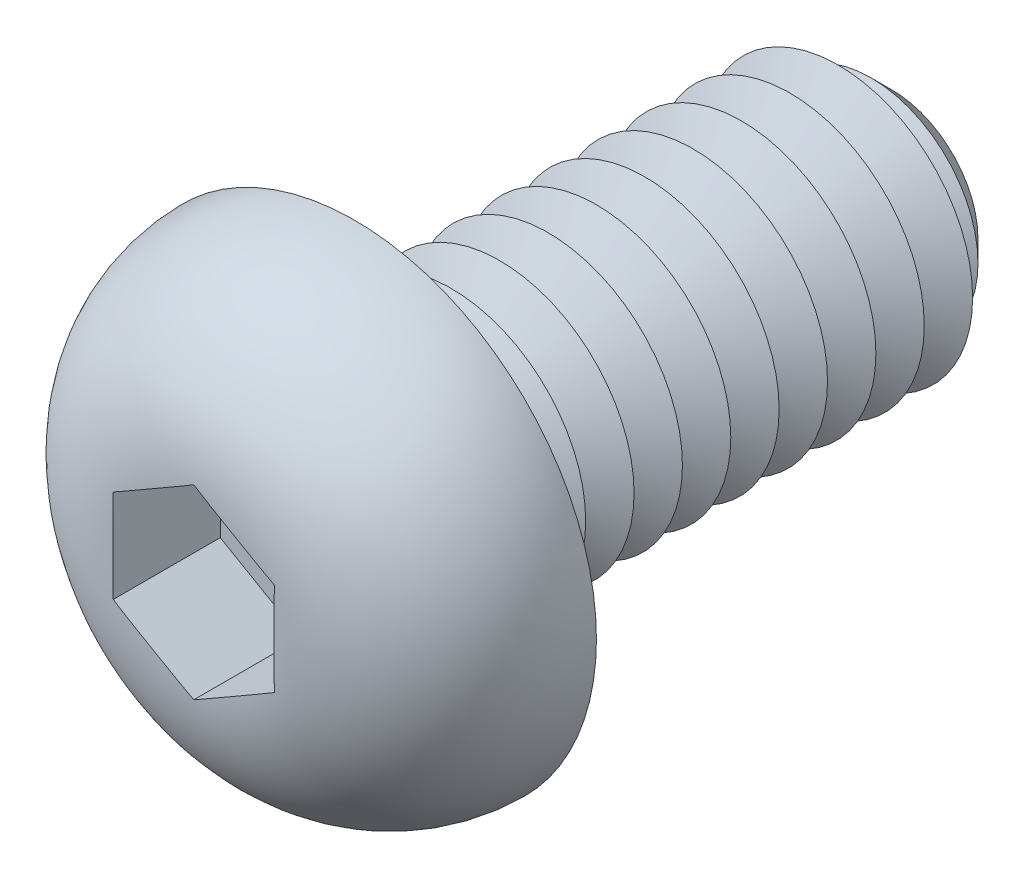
ISO-10303-21;
HEADER;
FILE_DESCRIPTION(('STEP AP214'),'2;1');
FILE_NAME('part.step','',(''),(''),'','','');
FILE_SCHEMA(('AUTOMOTIVE_DESIGN { 1 0 10303 214 1 1 1 1 }'));
ENDSEC;
DATA;
#1=APPLICATION_CONTEXT('core data for automotive mechanical design processes');
#2=APPLICATION_PROTOCOL_DEFINITION('international standard','automotive_design',2000,#1);
#3=PRODUCT_CONTEXT('',#1,'mechanical');
#4=PRODUCT('Part','Part','',(#3));
#5=PRODUCT_RELATED_PRODUCT_CATEGORY('part','',(#4));
#6=PRODUCT_DEFINITION_FORMATION('','',#4);
#7=PRODUCT_DEFINITION_CONTEXT('part definition',#1,'design');
#8=PRODUCT_DEFINITION('design','',#6,#7);
#9=PRODUCT_DEFINITION_SHAPE('','',#8);
#10=(LENGTH_UNIT() NAMED_UNIT(*) SI_UNIT(.MILLI.,.METRE.));
#11=(NAMED_UNIT(*) PLANE_ANGLE_UNIT() SI_UNIT($,.RADIAN.));
#12=(NAMED_UNIT(*) SI_UNIT($,.STERADIAN.) SOLID_ANGLE_UNIT());
#13=UNCERTAINTY_MEASURE_WITH_UNIT(LENGTH_MEASURE(1.E-05),#10,'distance_accuracy_value','');
#14=(GEOMETRIC_REPRESENTATION_CONTEXT(3) GLOBAL_UNCERTAINTY_ASSIGNED_CONTEXT((#13)) GLOBAL_UNIT_ASSIGNED_CONTEXT((#10,
#11,#12)) REPRESENTATION_CONTEXT('',''));
#15=CARTESIAN_POINT('',(0.,0.,0.));
#16=DIRECTION('',(0.,0.,1.));
#17=DIRECTION('',(1.,0.,0.));
#18=AXIS2_PLACEMENT_3D('',#15,#16,#17);
#19=CARTESIAN_POINT('',(0.,0.,-5.));
#20=DIRECTION('',(0.,0.,1.));
#21=DIRECTION('',(1.,0.,0.));
#22=AXIS2_PLACEMENT_3D('',#19,#20,#21);
#23=CYLINDRICAL_SURFACE('',#22,1.25);
#24=CARTESIAN_POINT('',(0.,0.,-0.225));
#25=DIRECTION('',(0.,0.,1.));
#26=DIRECTION('',(1.,0.,0.));
#27=AXIS2_PLACEMENT_3D('',#24,#25,#26);
#28=CIRCLE('',#27,1.25);
#29=CARTESIAN_POINT('',(1.25,0.,-0.225));
#30=VERTEX_POINT('',#29);
#31=EDGE_CURVE('E48',#30,#30,#28,.F.);
#32=ORIENTED_EDGE('',*,*,#31,.T.);
#33=EDGE_LOOP('',(#32));
#34=FACE_BOUND('',#33,.T.);
#35=CARTESIAN_POINT('',(0.,0.,-0.449999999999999));
#36=DIRECTION('',(0.,0.,1.));
#37=DIRECTION('',(1.,0.,0.));
#38=AXIS2_PLACEMENT_3D('',#35,#36,#37);
#39=CIRCLE('',#38,1.25);
#40=CARTESIAN_POINT('',(1.25,0.,-0.449999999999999));
#41=VERTEX_POINT('',#40);
#42=EDGE_CURVE('E116',#41,#41,#39,.T.);
#43=ORIENTED_EDGE('',*,*,#42,.T.);
#44=EDGE_LOOP('',(#43));
#45=FACE_BOUND('',#44,.T.);
#46=ADVANCED_FACE('F39',(#34,#45),#23,.T.);
#47=CARTESIAN_POINT('',(0.,2.25,0.));
#48=DIRECTION('',(0.,0.,1.));
#49=DIRECTION('',(1.,0.,0.));
#50=AXIS2_PLACEMENT_3D('',#47,#48,#49);
#51=PLANE('',#50);
#52=CARTESIAN_POINT('',(0.,0.,0.));
#53=DIRECTION('',(0.,0.,1.));
#54=DIRECTION('',(1.,0.,0.));
#55=AXIS2_PLACEMENT_3D('',#52,#53,#54);
#56=CIRCLE('',#55,1.475);
#57=CARTESIAN_POINT('',(1.475,0.,0.));
#58=VERTEX_POINT('',#57);
#59=EDGE_CURVE('E11',#58,#58,#56,.T.);
#60=ORIENTED_EDGE('',*,*,#59,.T.);
#61=EDGE_LOOP('',(#60));
#62=FACE_BOUND('',#61,.T.);
#63=CARTESIAN_POINT('',(0.,0.,0.));
#64=DIRECTION('',(0.,0.,1.));
#65=DIRECTION('',(1.,0.,0.));
#66=AXIS2_PLACEMENT_3D('',#63,#64,#65);
#67=CIRCLE('',#66,2.25);
#68=CARTESIAN_POINT('',(2.25,0.,0.));
#69=VERTEX_POINT('',#68);
#70=EDGE_CURVE('E139',#69,#69,#67,.T.);
#71=ORIENTED_EDGE('',*,*,#70,.F.);
#72=EDGE_LOOP('',(#71));
#73=FACE_BOUND('',#72,.T.);
#74=ADVANCED_FACE('F249',(#62,#73),#51,.F.);
#75=CARTESIAN_POINT('',(0.,0.,0.));
#76=DIRECTION('',(0.,0.,1.));
#77=DIRECTION('',(1.,0.,0.));
#78=AXIS2_PLACEMENT_3D('',#75,#76,#77);
#79=DEGENERATE_TOROIDAL_SURFACE('',#78,0.75,1.5,.T.);
#80=CARTESIAN_POINT('',(-0.00020000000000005,0.866140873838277,1.49549700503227));
#81=CARTESIAN_POINT('',(0.0310550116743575,0.848095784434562,1.4968946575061));
#82=CARTESIAN_POINT('',(0.0623199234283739,0.83004497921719,1.49783965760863));
#83=CARTESIAN_POINT('',(0.124855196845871,0.793940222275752,1.49913317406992));
#84=CARTESIAN_POINT('',(0.156125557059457,0.775886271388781,1.49948177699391));
#85=CARTESIAN_POINT('',(0.218662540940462,0.739780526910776,1.49989152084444));
#86=CARTESIAN_POINT('',(0.249929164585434,0.7217287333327,1.49995269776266));
#87=CARTESIAN_POINT('',(0.312463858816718,0.685624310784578,1.50000693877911));
#88=CARTESIAN_POINT('',(0.343731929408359,0.667571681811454,1.5));
#89=CARTESIAN_POINT('',(0.40626807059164,0.631466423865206,1.5));
#90=CARTESIAN_POINT('',(0.437536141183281,0.613413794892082,1.50000693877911));
#91=CARTESIAN_POINT('',(0.500070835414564,0.577309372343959,1.49995269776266));
#92=CARTESIAN_POINT('',(0.531337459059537,0.559257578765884,1.49989152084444));
#93=CARTESIAN_POINT('',(0.593874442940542,0.523151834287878,1.49948177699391));
#94=CARTESIAN_POINT('',(0.625144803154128,0.505097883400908,1.49913317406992));
#95=CARTESIAN_POINT('',(0.687680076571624,0.468993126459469,1.49783965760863));
#96=CARTESIAN_POINT('',(0.718944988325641,0.450942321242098,1.49689465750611));
#97=CARTESIAN_POINT('',(0.750199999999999,0.432897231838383,1.4954970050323));
#98=B_SPLINE_CURVE_WITH_KNOTS('',3,(#80,#81,#82,#83,#84,#85,#86,#87,#88,#89,#90,#91,#92,#93,#94,
#95,#96,#97),.UNSPECIFIED.,.F.,.F.,(4,2,2,2,2,2,2,2,4),(0.,0.108340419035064,0.216665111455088,
0.324976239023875,0.433291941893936,0.541607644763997,0.649918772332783,0.758243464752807,
0.866583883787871),.UNSPECIFIED.);
#99=CARTESIAN_POINT('',(0.,0.866025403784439,1.49550596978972));
#100=VERTEX_POINT('',#99);
#101=CARTESIAN_POINT('',(0.75,0.43301270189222,1.49550596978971));
#102=VERTEX_POINT('',#101);
#103=EDGE_CURVE('E62',#100,#102,#98,.T.);
#104=ORIENTED_EDGE('',*,*,#103,.T.);
#105=CARTESIAN_POINT('',(0.75,0.,1.5));
#106=CARTESIAN_POINT('',(0.75,-0.0627080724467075,1.50000006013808));
#107=CARTESIAN_POINT('',(0.75,-0.125416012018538,1.50006294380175));
#108=CARTESIAN_POINT('',(0.75,-0.250852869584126,1.49957707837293));
#109=CARTESIAN_POINT('',(0.75,-0.313581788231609,1.49902814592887));
#110=CARTESIAN_POINT('',(0.75,-0.438802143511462,1.49567950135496));
#111=CARTESIAN_POINT('',(0.75,-0.501293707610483,1.49288685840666));
#112=CARTESIAN_POINT('',(0.75,-0.625982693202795,1.48341085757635));
#113=CARTESIAN_POINT('',(0.75,-0.688180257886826,1.47672964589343));
#114=CARTESIAN_POINT('',(0.75,-0.798866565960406,1.46016399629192));
#115=CARTESIAN_POINT('',(0.75,-0.847497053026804,1.45124406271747));
#116=CARTESIAN_POINT('',(0.75,-0.943962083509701,1.42976864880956));
#117=CARTESIAN_POINT('',(0.75,-0.991796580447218,1.41721295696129));
#118=CARTESIAN_POINT('',(0.75,-1.08630476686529,1.38817887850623));
#119=CARTESIAN_POINT('',(0.75,-1.13297775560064,1.37169818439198));
#120=CARTESIAN_POINT('',(0.75,-1.22469462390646,1.33469293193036));
#121=CARTESIAN_POINT('',(0.75,-1.26973805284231,1.31416726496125));
#122=CARTESIAN_POINT('',(0.75,-1.40247100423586,1.24607127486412));
#123=CARTESIAN_POINT('',(0.750000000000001,-1.48705462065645,1.19219273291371));
#124=CARTESIAN_POINT('',(0.750000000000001,-1.64393724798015,1.06881737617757));
#125=CARTESIAN_POINT('',(0.750000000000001,-1.71623917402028,0.99932427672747));
#126=CARTESIAN_POINT('',(0.750000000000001,-1.83613547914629,0.857842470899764));
#127=CARTESIAN_POINT('',(0.750000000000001,-1.88577468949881,0.787579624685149));
#128=CARTESIAN_POINT('',(0.750000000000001,-1.97175648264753,0.639365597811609));
#129=CARTESIAN_POINT('',(0.750000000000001,-2.00810707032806,0.56141908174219));
#130=CARTESIAN_POINT('',(0.750000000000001,-2.06466924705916,0.404589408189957));
#131=CARTESIAN_POINT('',(0.750000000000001,-2.08563938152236,0.325978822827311));
#132=CARTESIAN_POINT('',(0.750000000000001,-2.11383941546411,0.166329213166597));
#133=CARTESIAN_POINT('',(0.750000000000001,-2.12107071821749,0.0852904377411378));
#134=CARTESIAN_POINT('',(0.750000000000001,-2.12155325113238,-0.0754758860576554));
#135=CARTESIAN_POINT('',(0.750000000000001,-2.11503465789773,-0.155202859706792));
#136=CARTESIAN_POINT('',(0.750000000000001,-2.08869127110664,-0.312426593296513));
#137=CARTESIAN_POINT('',(0.750000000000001,-2.06886647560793,-0.389923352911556));
#138=CARTESIAN_POINT('',(0.750000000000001,-2.01655236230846,-0.540457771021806));
#139=CARTESIAN_POINT('',(0.750000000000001,-1.98407088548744,-0.613498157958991));
#140=CARTESIAN_POINT('',(0.750000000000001,-1.9074704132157,-0.753167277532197));
#141=CARTESIAN_POINT('',(0.750000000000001,-1.86335369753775,-0.81979726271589));
#142=CARTESIAN_POINT('',(0.750000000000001,-1.76418094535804,-0.945786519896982));
#143=CARTESIAN_POINT('',(0.750000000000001,-1.70898715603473,-1.00503724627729));
#144=CARTESIAN_POINT('',(0.750000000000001,-1.58971135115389,-1.11387170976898));
#145=CARTESIAN_POINT('',(0.75,-1.52562045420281,-1.16344566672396));
#146=CARTESIAN_POINT('',(0.75,-1.38780810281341,-1.25370948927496));
#147=CARTESIAN_POINT('',(0.75,-1.31380696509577,-1.29397311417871));
#148=CARTESIAN_POINT('',(0.75,-1.19908931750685,-1.34544517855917));
#149=CARTESIAN_POINT('',(0.75,-1.16029271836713,-1.36109820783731));
#150=CARTESIAN_POINT('',(0.75,-1.08166825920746,-1.38954640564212));
#151=CARTESIAN_POINT('',(0.75,-1.04184052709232,-1.40234192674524));
#152=CARTESIAN_POINT('',(0.75,-0.922724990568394,-1.43614112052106));
#153=CARTESIAN_POINT('',(0.75,-0.842305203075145,-1.45321262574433));
#154=CARTESIAN_POINT('',(0.75,-0.680054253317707,-1.47833811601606));
#155=CARTESIAN_POINT('',(0.75,-0.598220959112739,-1.48637700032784));
#156=CARTESIAN_POINT('',(0.75,-0.432952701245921,-1.4964806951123));
#157=CARTESIAN_POINT('',(0.75,-0.349513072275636,-1.49844778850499));
#158=CARTESIAN_POINT('',(0.75,-0.224384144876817,-1.49972680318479));
#159=CARTESIAN_POINT('',(0.75,-0.182687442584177,-1.49987466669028));
#160=CARTESIAN_POINT('',(0.75,-0.0992944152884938,-1.50001027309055));
#161=CARTESIAN_POINT('',(0.75,-0.0575980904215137,-1.49999802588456));
#162=CARTESIAN_POINT('',(0.75,0.0343362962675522,-1.50000235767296));
#163=CARTESIAN_POINT('',(0.75,0.0845742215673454,-1.50002535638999));
#164=CARTESIAN_POINT('',(0.75,0.185055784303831,-1.49987831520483));
#165=CARTESIAN_POINT('',(0.75,0.235299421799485,-1.49970825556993));
#166=CARTESIAN_POINT('',(0.75,0.335816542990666,-1.49845206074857));
#167=CARTESIAN_POINT('',(0.75,0.386090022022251,-1.49736526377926));
#168=CARTESIAN_POINT('',(0.75,0.486569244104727,-1.49338674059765));
#169=CARTESIAN_POINT('',(0.75,0.536774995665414,-1.49049526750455));
#170=CARTESIAN_POINT('',(0.75,0.636034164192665,-1.4821682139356));
#171=CARTESIAN_POINT('',(0.75,0.685091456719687,-1.47678164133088));
#172=CARTESIAN_POINT('',(0.75,0.78275573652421,-1.46286947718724));
#173=CARTESIAN_POINT('',(0.75,0.831362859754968,-1.45434486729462));
#174=CARTESIAN_POINT('',(0.75,0.92771552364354,-1.43373454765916));
#175=CARTESIAN_POINT('',(0.75,0.975462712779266,-1.42165664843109));
#176=CARTESIAN_POINT('',(0.75,1.06980144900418,-1.39365234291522));
#177=CARTESIAN_POINT('',(0.75,1.11639353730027,-1.37772777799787));
#178=CARTESIAN_POINT('',(0.75,1.20164461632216,-1.3443737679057));
#179=CARTESIAN_POINT('',(0.75,1.24050600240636,-1.32746129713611));
#180=CARTESIAN_POINT('',(0.75,1.31679530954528,-1.29064565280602));
#181=CARTESIAN_POINT('',(0.75,1.35422305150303,-1.27074210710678));
#182=CARTESIAN_POINT('',(0.75,1.42755003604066,-1.22785786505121));
#183=CARTESIAN_POINT('',(0.75,1.46343995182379,-1.20486115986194));
#184=CARTESIAN_POINT('',(0.75,1.53317270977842,-1.15597138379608));
#185=CARTESIAN_POINT('',(0.75,1.56701570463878,-1.1300785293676));
#186=CARTESIAN_POINT('',(0.75,1.66513078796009,-1.04815589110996));
#187=CARTESIAN_POINT('',(0.75,1.72596640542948,-0.987895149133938));
#188=CARTESIAN_POINT('',(0.75,1.83611610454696,-0.857815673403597));
#189=CARTESIAN_POINT('',(0.75,1.88544739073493,-0.78801146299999));
#190=CARTESIAN_POINT('',(0.75,1.96970141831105,-0.64303465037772));
#191=CARTESIAN_POINT('',(0.75,2.00501928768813,-0.568092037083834));
#192=CARTESIAN_POINT('',(0.75,2.06216371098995,-0.413201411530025));
#193=CARTESIAN_POINT('',(0.75,2.08398748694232,-0.333252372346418));
#194=CARTESIAN_POINT('',(0.75,2.11297506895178,-0.173098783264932));
#195=CARTESIAN_POINT('',(0.75,2.12053880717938,-0.0929664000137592));
#196=CARTESIAN_POINT('',(0.75,2.1219864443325,0.0674127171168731));
#197=CARTESIAN_POINT('',(0.75,2.1158724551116,0.147659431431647));
#198=CARTESIAN_POINT('',(0.75,2.09026719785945,0.305329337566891));
#199=CARTESIAN_POINT('',(0.75,2.07088260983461,0.382769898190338));
#200=CARTESIAN_POINT('',(0.75,2.01945905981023,0.53332273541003));
#201=CARTESIAN_POINT('',(0.75,1.98742024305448,0.606435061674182));
#202=CARTESIAN_POINT('',(0.75,1.91146692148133,0.746751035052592));
#203=CARTESIAN_POINT('',(0.75,1.86748433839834,0.813917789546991));
#204=CARTESIAN_POINT('',(0.75,1.76910058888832,0.940116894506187));
#205=CARTESIAN_POINT('',(0.75,1.71469868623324,0.999148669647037));
#206=CARTESIAN_POINT('',(0.75,1.59577189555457,1.10896258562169));
#207=CARTESIAN_POINT('',(0.75,1.53104176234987,1.15952203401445));
#208=CARTESIAN_POINT('',(0.75,1.3944150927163,1.24972990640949));
#209=CARTESIAN_POINT('',(0.75,1.32251811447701,1.28937765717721));
#210=CARTESIAN_POINT('',(0.75,1.16914901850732,1.35951213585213));
#211=CARTESIAN_POINT('',(0.75,1.08736098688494,1.38930295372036));
#212=CARTESIAN_POINT('',(0.75,0.920496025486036,1.43689243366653));
#213=CARTESIAN_POINT('',(0.75,0.835420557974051,1.45469636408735));
#214=CARTESIAN_POINT('',(0.75,0.687870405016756,1.476773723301));
#215=CARTESIAN_POINT('',(0.75,0.625720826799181,1.48343749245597));
#216=CARTESIAN_POINT('',(0.75,0.501109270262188,1.49289411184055));
#217=CARTESIAN_POINT('',(0.75,0.438647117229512,1.49568447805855));
#218=CARTESIAN_POINT('',(0.75,0.313477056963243,1.49903009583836));
#219=CARTESIAN_POINT('',(0.75,0.250769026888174,1.49957783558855));
#220=CARTESIAN_POINT('',(0.75,0.125373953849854,1.50006266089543));
#221=CARTESIAN_POINT('',(0.75,0.0626869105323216,1.49999993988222));
#222=CARTESIAN_POINT('',(0.75,0.,1.5));
#223=B_SPLINE_CURVE_WITH_KNOTS('',3,(#105,#106,#107,#108,#109,#110,#111,#112,#113,#114,#115,
#116,#117,#118,#119,#120,#121,#122,#123,#124,#125,#126,#127,#128,#129,#130,#131,#132,#133,#134,
#135,#136,#137,#138,#139,#140,#141,#142,#143,#144,#145,#146,#147,#148,#149,#150,#151,#152,#153,
#154,#155,#156,#157,#158,#159,#160,#161,#162,#163,#164,#165,#166,#167,#168,#169,#170,#171,#172,
#173,#174,#175,#176,#177,#178,#179,#180,#181,#182,#183,#184,#185,#186,#187,#188,#189,#190,#191,
#192,#193,#194,#195,#196,#197,#198,#199,#200,#201,#202,#203,#204,#205,#206,#207,#208,#209,#210,
#211,#212,#213,#214,#215,#216,#217,#218,#219,#220,#221,#222),.UNSPECIFIED.,.T.,.F.,(4,2,2,2,2,2,
2,2,2,2,2,2,2,2,2,2,2,2,2,2,2,2,2,2,2,2,2,2,2,2,2,2,2,2,2,2,2,2,2,2,2,2,2,2,2,2,2,2,2,2,2,2,2,2,
2,2,2,2,4),(0.,0.188125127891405,0.376306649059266,0.563897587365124,0.75138508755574,
0.899588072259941,1.04779968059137,1.19609863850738,1.34443829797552,1.64330264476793,
1.94209595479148,2.19886247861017,2.45547407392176,2.69837467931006,2.94125047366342,
3.18009276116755,3.418935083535,3.65762967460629,3.89627753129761,4.13810096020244,
4.38016754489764,4.63175737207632,4.75717060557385,4.88256835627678,5.12849835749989,
5.37483889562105,5.62512380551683,5.75021912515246,5.87530671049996,6.02602122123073,
6.17675113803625,6.32758995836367,6.47840762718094,6.62638101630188,6.77430815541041,
6.92191253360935,7.06944639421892,7.19647012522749,7.32350967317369,7.4512340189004,
7.57894882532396,7.83445576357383,8.08957810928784,8.33688433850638,8.58424146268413,
8.82455168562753,9.06482480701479,9.30318875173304,9.54154996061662,9.781299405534,
10.0210657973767,10.266384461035,10.511718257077,10.7718340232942,11.0318353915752,
11.219209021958,11.4067027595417,11.5948240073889,11.7828856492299),.UNSPECIFIED.);
#224=CARTESIAN_POINT('',(0.75,-0.43301270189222,1.49550596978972));
#225=VERTEX_POINT('',#224);
#226=EDGE_CURVE('E214',#102,#225,#223,.T.);
#227=ORIENTED_EDGE('',*,*,#226,.T.);
#228=CARTESIAN_POINT('',(0.7502,-0.432897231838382,1.49549700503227));
#229=CARTESIAN_POINT('',(0.718944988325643,-0.450942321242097,1.4968946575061));
#230=CARTESIAN_POINT('',(0.687680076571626,-0.468993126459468,1.49783965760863));
#231=CARTESIAN_POINT('',(0.625144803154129,-0.505097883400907,1.49913317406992));
#232=CARTESIAN_POINT('',(0.593874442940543,-0.523151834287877,1.49948177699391));
#233=CARTESIAN_POINT('',(0.531337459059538,-0.559257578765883,1.49989152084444));
#234=CARTESIAN_POINT('',(0.500070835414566,-0.577309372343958,1.49995269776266));
#235=CARTESIAN_POINT('',(0.437536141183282,-0.613413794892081,1.50000693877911));
#236=CARTESIAN_POINT('',(0.406268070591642,-0.631466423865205,1.5));
#237=CARTESIAN_POINT('',(0.34373192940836,-0.667571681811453,1.5));
#238=CARTESIAN_POINT('',(0.312463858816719,-0.685624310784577,1.50000693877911));
#239=CARTESIAN_POINT('',(0.249929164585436,-0.721728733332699,1.49995269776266));
#240=CARTESIAN_POINT('',(0.218662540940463,-0.739780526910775,1.49989152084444));
#241=CARTESIAN_POINT('',(0.156125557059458,-0.77588627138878,1.49948177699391));
#242=CARTESIAN_POINT('',(0.124855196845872,-0.793940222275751,1.49913317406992));
#243=CARTESIAN_POINT('',(0.0623199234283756,-0.830044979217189,1.49783965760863));
#244=CARTESIAN_POINT('',(0.0310550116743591,-0.848095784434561,1.49689465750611));
#245=CARTESIAN_POINT('',(-0.000199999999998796,-0.866140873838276,1.4954970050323));
#246=B_SPLINE_CURVE_WITH_KNOTS('',3,(#228,#229,#230,#231,#232,#233,#234,#235,#236,#237,#238,
#239,#240,#241,#242,#243,#244,#245),.UNSPECIFIED.,.F.,.F.,(4,2,2,2,2,2,2,2,4),(0.,
0.108340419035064,0.216665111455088,0.324976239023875,0.433291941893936,0.541607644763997,
0.649918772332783,0.758243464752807,0.866583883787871),.UNSPECIFIED.);
#247=CARTESIAN_POINT('',(0.,-0.866025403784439,1.49550596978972));
#248=VERTEX_POINT('',#247);
#249=EDGE_CURVE('E194',#225,#248,#246,.T.);
#250=ORIENTED_EDGE('',*,*,#249,.T.);
#251=CARTESIAN_POINT('',(0.000200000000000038,-0.866140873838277,1.49549700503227));
#252=CARTESIAN_POINT('',(-0.0310550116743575,-0.848095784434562,1.4968946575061));
#253=CARTESIAN_POINT('',(-0.0623199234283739,-0.83004497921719,1.49783965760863));
#254=CARTESIAN_POINT('',(-0.124855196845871,-0.793940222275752,1.49913317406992));
#255=CARTESIAN_POINT('',(-0.156125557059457,-0.775886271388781,1.49948177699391));
#256=CARTESIAN_POINT('',(-0.218662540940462,-0.739780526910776,1.49989152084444));
#257=CARTESIAN_POINT('',(-0.249929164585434,-0.7217287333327,1.49995269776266));
#258=CARTESIAN_POINT('',(-0.312463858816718,-0.685624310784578,1.50000693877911));
#259=CARTESIAN_POINT('',(-0.343731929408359,-0.667571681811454,1.5));
#260=CARTESIAN_POINT('',(-0.40626807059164,-0.631466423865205,1.5));
#261=CARTESIAN_POINT('',(-0.437536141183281,-0.613413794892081,1.50000693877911));
#262=CARTESIAN_POINT('',(-0.500070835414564,-0.577309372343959,1.49995269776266));
#263=CARTESIAN_POINT('',(-0.531337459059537,-0.559257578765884,1.49989152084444));
#264=CARTESIAN_POINT('',(-0.593874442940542,-0.523151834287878,1.49948177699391));
#265=CARTESIAN_POINT('',(-0.625144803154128,-0.505097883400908,1.49913317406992));
#266=CARTESIAN_POINT('',(-0.687680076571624,-0.468993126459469,1.49783965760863));
#267=CARTESIAN_POINT('',(-0.718944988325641,-0.450942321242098,1.49689465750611));
#268=CARTESIAN_POINT('',(-0.750199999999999,-0.432897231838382,1.4954970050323));
#269=B_SPLINE_CURVE_WITH_KNOTS('',3,(#251,#252,#253,#254,#255,#256,#257,#258,#259,#260,#261,
#262,#263,#264,#265,#266,#267,#268),.UNSPECIFIED.,.F.,.F.,(4,2,2,2,2,2,2,2,4),(0.,
0.108340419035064,0.216665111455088,0.324976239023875,0.433291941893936,0.541607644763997,
0.649918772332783,0.758243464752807,0.866583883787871),.UNSPECIFIED.);
#270=CARTESIAN_POINT('',(-0.75,-0.433012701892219,1.49550596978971));
#271=VERTEX_POINT('',#270);
#272=EDGE_CURVE('E187',#248,#271,#269,.T.);
#273=ORIENTED_EDGE('',*,*,#272,.T.);
#274=CARTESIAN_POINT('',(-0.75,0.,1.5));
#275=CARTESIAN_POINT('',(-0.75,0.0627080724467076,1.50000006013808));
#276=CARTESIAN_POINT('',(-0.75,0.125416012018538,1.50006294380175));
#277=CARTESIAN_POINT('',(-0.75,0.250852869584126,1.49957707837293));
#278=CARTESIAN_POINT('',(-0.75,0.313581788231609,1.49902814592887));
#279=CARTESIAN_POINT('',(-0.75,0.438802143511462,1.49567950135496));
#280=CARTESIAN_POINT('',(-0.75,0.501293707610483,1.49288685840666));
#281=CARTESIAN_POINT('',(-0.75,0.625982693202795,1.48341085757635));
#282=CARTESIAN_POINT('',(-0.75,0.688180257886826,1.47672964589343));
#283=CARTESIAN_POINT('',(-0.75,0.798866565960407,1.46016399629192));
#284=CARTESIAN_POINT('',(-0.75,0.847497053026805,1.45124406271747));
#285=CARTESIAN_POINT('',(-0.75,0.943962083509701,1.42976864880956));
#286=CARTESIAN_POINT('',(-0.75,0.991796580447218,1.41721295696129));
#287=CARTESIAN_POINT('',(-0.75,1.08630476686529,1.38817887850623));
#288=CARTESIAN_POINT('',(-0.75,1.13297775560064,1.37169818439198));
#289=CARTESIAN_POINT('',(-0.75,1.22469462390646,1.33469293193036));
#290=CARTESIAN_POINT('',(-0.75,1.26973805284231,1.31416726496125));
#291=CARTESIAN_POINT('',(-0.75,1.40247100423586,1.24607127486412));
#292=CARTESIAN_POINT('',(-0.75,1.48705462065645,1.19219273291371));
#293=CARTESIAN_POINT('',(-0.75,1.64393724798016,1.06881737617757));
#294=CARTESIAN_POINT('',(-0.75,1.71623917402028,0.99932427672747));
#295=CARTESIAN_POINT('',(-0.75,1.83613547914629,0.857842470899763));
#296=CARTESIAN_POINT('',(-0.75,1.88577468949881,0.787579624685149));
#297=CARTESIAN_POINT('',(-0.75,1.97175648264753,0.639365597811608));
#298=CARTESIAN_POINT('',(-0.75,2.00810707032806,0.561419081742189));
#299=CARTESIAN_POINT('',(-0.75,2.06466924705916,0.404589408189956));
#300=CARTESIAN_POINT('',(-0.75,2.08563938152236,0.325978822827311));
#301=CARTESIAN_POINT('',(-0.75,2.11383941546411,0.166329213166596));
#302=CARTESIAN_POINT('',(-0.75,2.12107071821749,0.0852904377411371));
#303=CARTESIAN_POINT('',(-0.75,2.12155325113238,-0.0754758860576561));
#304=CARTESIAN_POINT('',(-0.75,2.11503465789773,-0.155202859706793));
#305=CARTESIAN_POINT('',(-0.75,2.08869127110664,-0.312426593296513));
#306=CARTESIAN_POINT('',(-0.75,2.06886647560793,-0.389923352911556));
#307=CARTESIAN_POINT('',(-0.75,2.01655236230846,-0.540457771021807));
#308=CARTESIAN_POINT('',(-0.75,1.98407088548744,-0.613498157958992));
#309=CARTESIAN_POINT('',(-0.75,1.9074704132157,-0.753167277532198));
#310=CARTESIAN_POINT('',(-0.75,1.86335369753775,-0.81979726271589));
#311=CARTESIAN_POINT('',(-0.75,1.76418094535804,-0.945786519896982));
#312=CARTESIAN_POINT('',(-0.75,1.70898715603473,-1.00503724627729));
#313=CARTESIAN_POINT('',(-0.75,1.58971135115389,-1.11387170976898));
#314=CARTESIAN_POINT('',(-0.75,1.52562045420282,-1.16344566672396));
#315=CARTESIAN_POINT('',(-0.75,1.38780810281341,-1.25370948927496));
#316=CARTESIAN_POINT('',(-0.75,1.31380696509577,-1.29397311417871));
#317=CARTESIAN_POINT('',(-0.75,1.19908931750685,-1.34544517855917));
#318=CARTESIAN_POINT('',(-0.75,1.16029271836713,-1.36109820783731));
#319=CARTESIAN_POINT('',(-0.75,1.08166825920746,-1.38954640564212));
#320=CARTESIAN_POINT('',(-0.75,1.04184052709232,-1.40234192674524));
#321=CARTESIAN_POINT('',(-0.75,0.922724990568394,-1.43614112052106));
#322=CARTESIAN_POINT('',(-0.75,0.842305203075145,-1.45321262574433));
#323=CARTESIAN_POINT('',(-0.75,0.680054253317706,-1.47833811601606));
#324=CARTESIAN_POINT('',(-0.75,0.598220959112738,-1.48637700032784));
#325=CARTESIAN_POINT('',(-0.75,0.43295270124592,-1.4964806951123));
#326=CARTESIAN_POINT('',(-0.75,0.349513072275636,-1.49844778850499));
#327=CARTESIAN_POINT('',(-0.75,0.224384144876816,-1.49972680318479));
#328=CARTESIAN_POINT('',(-0.75,0.182687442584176,-1.49987466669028));
#329=CARTESIAN_POINT('',(-0.75,0.0992944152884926,-1.50001027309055));
#330=CARTESIAN_POINT('',(-0.75,0.0575980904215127,-1.49999802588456));
#331=CARTESIAN_POINT('',(-0.75,-0.0343362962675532,-1.50000235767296));
#332=CARTESIAN_POINT('',(-0.75,-0.0845742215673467,-1.50002535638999));
#333=CARTESIAN_POINT('',(-0.75,-0.185055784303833,-1.49987831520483));
#334=CARTESIAN_POINT('',(-0.75,-0.235299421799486,-1.49970825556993));
#335=CARTESIAN_POINT('',(-0.75,-0.335816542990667,-1.49845206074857));
#336=CARTESIAN_POINT('',(-0.75,-0.386090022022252,-1.49736526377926));
#337=CARTESIAN_POINT('',(-0.75,-0.486569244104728,-1.49338674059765));
#338=CARTESIAN_POINT('',(-0.75,-0.536774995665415,-1.49049526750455));
#339=CARTESIAN_POINT('',(-0.75,-0.636034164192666,-1.4821682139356));
#340=CARTESIAN_POINT('',(-0.75,-0.685091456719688,-1.47678164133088));
#341=CARTESIAN_POINT('',(-0.75,-0.782755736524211,-1.46286947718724));
#342=CARTESIAN_POINT('',(-0.75,-0.831362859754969,-1.45434486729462));
#343=CARTESIAN_POINT('',(-0.75,-0.927715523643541,-1.43373454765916));
#344=CARTESIAN_POINT('',(-0.75,-0.975462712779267,-1.42165664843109));
#345=CARTESIAN_POINT('',(-0.75,-1.06980144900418,-1.39365234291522));
#346=CARTESIAN_POINT('',(-0.75,-1.11639353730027,-1.37772777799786));
#347=CARTESIAN_POINT('',(-0.75,-1.20164461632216,-1.3443737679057));
#348=CARTESIAN_POINT('',(-0.75,-1.24050600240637,-1.32746129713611));
#349=CARTESIAN_POINT('',(-0.75,-1.31679530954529,-1.29064565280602));
#350=CARTESIAN_POINT('',(-0.75,-1.35422305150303,-1.27074210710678));
#351=CARTESIAN_POINT('',(-0.75,-1.42755003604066,-1.22785786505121));
#352=CARTESIAN_POINT('',(-0.75,-1.46343995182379,-1.20486115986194));
#353=CARTESIAN_POINT('',(-0.75,-1.53317270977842,-1.15597138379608));
#354=CARTESIAN_POINT('',(-0.75,-1.56701570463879,-1.1300785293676));
#355=CARTESIAN_POINT('',(-0.75,-1.66513078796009,-1.04815589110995));
#356=CARTESIAN_POINT('',(-0.75,-1.72596640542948,-0.987895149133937));
#357=CARTESIAN_POINT('',(-0.75,-1.83611610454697,-0.857815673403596));
#358=CARTESIAN_POINT('',(-0.75,-1.88544739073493,-0.788011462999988));
#359=CARTESIAN_POINT('',(-0.75,-1.96970141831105,-0.643034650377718));
#360=CARTESIAN_POINT('',(-0.75,-2.00501928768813,-0.568092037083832));
#361=CARTESIAN_POINT('',(-0.75,-2.06216371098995,-0.413201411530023));
#362=CARTESIAN_POINT('',(-0.75,-2.08398748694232,-0.333252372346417));
#363=CARTESIAN_POINT('',(-0.75,-2.11297506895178,-0.173098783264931));
#364=CARTESIAN_POINT('',(-0.75,-2.12053880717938,-0.0929664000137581));
#365=CARTESIAN_POINT('',(-0.75,-2.1219864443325,0.0674127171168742));
#366=CARTESIAN_POINT('',(-0.75,-2.1158724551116,0.147659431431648));
#367=CARTESIAN_POINT('',(-0.75,-2.09026719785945,0.305329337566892));
#368=CARTESIAN_POINT('',(-0.75,-2.07088260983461,0.382769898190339));
#369=CARTESIAN_POINT('',(-0.75,-2.01945905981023,0.533322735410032));
#370=CARTESIAN_POINT('',(-0.75,-1.98742024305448,0.606435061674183));
#371=CARTESIAN_POINT('',(-0.75,-1.91146692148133,0.746751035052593));
#372=CARTESIAN_POINT('',(-0.75,-1.86748433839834,0.813917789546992));
#373=CARTESIAN_POINT('',(-0.75,-1.76910058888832,0.940116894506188));
#374=CARTESIAN_POINT('',(-0.75,-1.71469868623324,0.999148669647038));
#375=CARTESIAN_POINT('',(-0.75,-1.59577189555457,1.10896258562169));
#376=CARTESIAN_POINT('',(-0.75,-1.53104176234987,1.15952203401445));
#377=CARTESIAN_POINT('',(-0.75,-1.3944150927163,1.24972990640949));
#378=CARTESIAN_POINT('',(-0.75,-1.32251811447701,1.28937765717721));
#379=CARTESIAN_POINT('',(-0.75,-1.16914901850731,1.35951213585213));
#380=CARTESIAN_POINT('',(-0.75,-1.08736098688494,1.38930295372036));
#381=CARTESIAN_POINT('',(-0.75,-0.920496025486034,1.43689243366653));
#382=CARTESIAN_POINT('',(-0.75,-0.83542055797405,1.45469636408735));
#383=CARTESIAN_POINT('',(-0.75,-0.687870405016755,1.476773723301));
#384=CARTESIAN_POINT('',(-0.75,-0.625720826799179,1.48343749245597));
#385=CARTESIAN_POINT('',(-0.75,-0.501109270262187,1.49289411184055));
#386=CARTESIAN_POINT('',(-0.75,-0.438647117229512,1.49568447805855));
#387=CARTESIAN_POINT('',(-0.75,-0.313477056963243,1.49903009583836));
#388=CARTESIAN_POINT('',(-0.75,-0.250769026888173,1.49957783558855));
#389=CARTESIAN_POINT('',(-0.75,-0.125373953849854,1.50006266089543));
#390=CARTESIAN_POINT('',(-0.75,-0.0626869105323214,1.49999993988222));
#391=CARTESIAN_POINT('',(-0.75,0.,1.5));
#392=B_SPLINE_CURVE_WITH_KNOTS('',3,(#274,#275,#276,#277,#278,#279,#280,#281,#282,#283,#284,
#285,#286,#287,#288,#289,#290,#291,#292,#293,#294,#295,#296,#297,#298,#299,#300,#301,#302,#303,
#304,#305,#306,#307,#308,#309,#310,#311,#312,#313,#314,#315,#316,#317,#318,#319,#320,#321,#322,
#323,#324,#325,#326,#327,#328,#329,#330,#331,#332,#333,#334,#335,#336,#337,#338,#339,#340,#341,
#342,#343,#344,#345,#346,#347,#348,#349,#350,#351,#352,#353,#354,#355,#356,#357,#358,#359,#360,
#361,#362,#363,#364,#365,#366,#367,#368,#369,#370,#371,#372,#373,#374,#375,#376,#377,#378,#379,
#380,#381,#382,#383,#384,#385,#386,#387,#388,#389,#390,#391),.UNSPECIFIED.,.T.,.F.,(4,2,2,2,2,2,
2,2,2,2,2,2,2,2,2,2,2,2,2,2,2,2,2,2,2,2,2,2,2,2,2,2,2,2,2,2,2,2,2,2,2,2,2,2,2,2,2,2,2,2,2,2,2,2,
2,2,2,2,4),(0.,0.188125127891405,0.376306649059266,0.563897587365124,0.75138508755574,
0.899588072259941,1.04779968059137,1.19609863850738,1.34443829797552,1.64330264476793,
1.94209595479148,2.19886247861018,2.45547407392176,2.69837467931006,2.94125047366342,
3.18009276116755,3.418935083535,3.65762967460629,3.89627753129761,4.13810096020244,
4.38016754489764,4.63175737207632,4.75717060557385,4.88256835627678,5.12849835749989,
5.37483889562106,5.62512380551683,5.75021912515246,5.87530671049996,6.02602122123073,
6.17675113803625,6.32758995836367,6.47840762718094,6.62638101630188,6.77430815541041,
6.92191253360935,7.06944639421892,7.19647012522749,7.32350967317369,7.4512340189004,
7.57894882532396,7.83445576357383,8.08957810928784,8.33688433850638,8.58424146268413,
8.82455168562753,9.06482480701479,9.30318875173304,9.54154996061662,9.781299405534,
10.0210657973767,10.266384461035,10.511718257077,10.7718340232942,11.0318353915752,
11.219209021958,11.4067027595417,11.5948240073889,11.7828856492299),.UNSPECIFIED.);
#393=CARTESIAN_POINT('',(-0.75,0.43301270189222,1.49550596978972));
#394=VERTEX_POINT('',#393);
#395=EDGE_CURVE('E165',#271,#394,#392,.T.);
#396=ORIENTED_EDGE('',*,*,#395,.T.);
#397=CARTESIAN_POINT('',(-0.7502,0.432897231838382,1.49549700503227));
#398=CARTESIAN_POINT('',(-0.718944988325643,0.450942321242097,1.4968946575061));
#399=CARTESIAN_POINT('',(-0.687680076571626,0.468993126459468,1.49783965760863));
#400=CARTESIAN_POINT('',(-0.62514480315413,0.505097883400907,1.49913317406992));
#401=CARTESIAN_POINT('',(-0.593874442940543,0.523151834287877,1.49948177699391));
#402=CARTESIAN_POINT('',(-0.531337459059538,0.559257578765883,1.49989152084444));
#403=CARTESIAN_POINT('',(-0.500070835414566,0.577309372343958,1.49995269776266));
#404=CARTESIAN_POINT('',(-0.437536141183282,0.613413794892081,1.50000693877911));
#405=CARTESIAN_POINT('',(-0.406268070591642,0.631466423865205,1.5));
#406=CARTESIAN_POINT('',(-0.34373192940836,0.667571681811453,1.5));
#407=CARTESIAN_POINT('',(-0.312463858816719,0.685624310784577,1.50000693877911));
#408=CARTESIAN_POINT('',(-0.249929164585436,0.721728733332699,1.49995269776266));
#409=CARTESIAN_POINT('',(-0.218662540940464,0.739780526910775,1.49989152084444));
#410=CARTESIAN_POINT('',(-0.156125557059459,0.77588627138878,1.49948177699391));
#411=CARTESIAN_POINT('',(-0.124855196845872,0.793940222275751,1.49913317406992));
#412=CARTESIAN_POINT('',(-0.0623199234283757,0.830044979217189,1.49783965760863));
#413=CARTESIAN_POINT('',(-0.0310550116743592,0.848095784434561,1.49689465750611));
#414=CARTESIAN_POINT('',(0.000199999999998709,0.866140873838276,1.4954970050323));
#415=B_SPLINE_CURVE_WITH_KNOTS('',3,(#397,#398,#399,#400,#401,#402,#403,#404,#405,#406,#407,
#408,#409,#410,#411,#412,#413,#414),.UNSPECIFIED.,.F.,.F.,(4,2,2,2,2,2,2,2,4),(0.,
0.108340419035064,0.216665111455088,0.324976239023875,0.433291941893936,0.541607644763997,
0.649918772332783,0.758243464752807,0.866583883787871),.UNSPECIFIED.);
#416=EDGE_CURVE('E157',#394,#100,#415,.T.);
#417=ORIENTED_EDGE('',*,*,#416,.T.);
#418=EDGE_LOOP('',(#104,#227,#250,#273,#396,#417));
#419=FACE_BOUND('',#418,.T.);
#420=ORIENTED_EDGE('',*,*,#70,.T.);
#421=EDGE_LOOP('',(#420));
#422=FACE_BOUND('',#421,.T.);
#423=ADVANCED_FACE('F170',(#419,#422),#79,.T.);
#424=CARTESIAN_POINT('',(0.75,0.43301270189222,0.5));
#425=DIRECTION('',(0.5,0.866025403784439,0.));
#426=DIRECTION('',(-0.866025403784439,0.5,0.));
#427=AXIS2_PLACEMENT_3D('',#424,#425,#426);
#428=PLANE('',#427);
#429=DIRECTION('',(0.,0.,1.));
#430=VECTOR('',#429,1.);
#431=CARTESIAN_POINT('',(0.,0.866025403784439,0.5));
#432=LINE('',#431,#430);
#433=CARTESIAN_POINT('',(0.,0.866025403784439,0.5));
#434=VERTEX_POINT('',#433);
#435=EDGE_CURVE('E55',#434,#100,#432,.T.);
#436=ORIENTED_EDGE('',*,*,#435,.F.);
#437=DIRECTION('',(-0.866025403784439,0.5,0.));
#438=VECTOR('',#437,1.);
#439=CARTESIAN_POINT('',(0.75,0.43301270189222,0.5));
#440=LINE('',#439,#438);
#441=CARTESIAN_POINT('',(0.75,0.43301270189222,0.5));
#442=VERTEX_POINT('',#441);
#443=EDGE_CURVE('E96',#442,#434,#440,.T.);
#444=ORIENTED_EDGE('',*,*,#443,.F.);
#445=DIRECTION('',(0.,0.,1.));
#446=VECTOR('',#445,1.);
#447=CARTESIAN_POINT('',(0.75,0.43301270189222,0.5));
#448=LINE('',#447,#446);
#449=EDGE_CURVE('E137',#442,#102,#448,.T.);
#450=ORIENTED_EDGE('',*,*,#449,.T.);
#451=ORIENTED_EDGE('',*,*,#103,.F.);
#452=EDGE_LOOP('',(#436,#444,#450,#451));
#453=FACE_BOUND('',#452,.T.);
#454=ADVANCED_FACE('F93',(#453),#428,.F.);
#455=CARTESIAN_POINT('',(0.75,-0.43301270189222,0.5));
#456=DIRECTION('',(1.,0.,0.));
#457=DIRECTION('',(0.,1.,0.));
#458=AXIS2_PLACEMENT_3D('',#455,#456,#457);
#459=PLANE('',#458);
#460=ORIENTED_EDGE('',*,*,#226,.F.);
#461=ORIENTED_EDGE('',*,*,#449,.F.);
#462=DIRECTION('',(0.,1.,0.));
#463=VECTOR('',#462,1.);
#464=CARTESIAN_POINT('',(0.75,-0.43301270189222,0.5));
#465=LINE('',#464,#463);
#466=CARTESIAN_POINT('',(0.75,-0.43301270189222,0.5));
#467=VERTEX_POINT('',#466);
#468=EDGE_CURVE('E100',#467,#442,#465,.T.);
#469=ORIENTED_EDGE('',*,*,#468,.F.);
#470=DIRECTION('',(0.,0.,1.));
#471=VECTOR('',#470,1.);
#472=CARTESIAN_POINT('',(0.75,-0.43301270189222,0.5));
#473=LINE('',#472,#471);
#474=EDGE_CURVE('E140',#467,#225,#473,.T.);
#475=ORIENTED_EDGE('',*,*,#474,.T.);
#476=EDGE_LOOP('',(#460,#461,#469,#475));
#477=FACE_BOUND('',#476,.T.);
#478=ADVANCED_FACE('F181',(#477),#459,.F.);
#479=CARTESIAN_POINT('',(0.,-0.866025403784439,0.5));
#480=DIRECTION('',(0.5,-0.866025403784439,0.));
#481=DIRECTION('',(0.866025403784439,0.5,0.));
#482=AXIS2_PLACEMENT_3D('',#479,#480,#481);
#483=PLANE('',#482);
#484=ORIENTED_EDGE('',*,*,#474,.F.);
#485=DIRECTION('',(0.866025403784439,0.5,0.));
#486=VECTOR('',#485,1.);
#487=CARTESIAN_POINT('',(0.,-0.866025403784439,0.5));
#488=LINE('',#487,#486);
#489=CARTESIAN_POINT('',(0.,-0.866025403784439,0.5));
#490=VERTEX_POINT('',#489);
#491=EDGE_CURVE('E132',#490,#467,#488,.T.);
#492=ORIENTED_EDGE('',*,*,#491,.F.);
#493=DIRECTION('',(0.,0.,1.));
#494=VECTOR('',#493,1.);
#495=CARTESIAN_POINT('',(0.,-0.866025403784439,0.5));
#496=LINE('',#495,#494);
#497=EDGE_CURVE('E144',#490,#248,#496,.T.);
#498=ORIENTED_EDGE('',*,*,#497,.T.);
#499=ORIENTED_EDGE('',*,*,#249,.F.);
#500=EDGE_LOOP('',(#484,#492,#498,#499));
#501=FACE_BOUND('',#500,.T.);
#502=ADVANCED_FACE('F203',(#501),#483,.F.);
#503=CARTESIAN_POINT('',(-0.75,-0.433012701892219,0.5));
#504=DIRECTION('',(-0.5,-0.866025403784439,0.));
#505=DIRECTION('',(0.866025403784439,-0.5,0.));
#506=AXIS2_PLACEMENT_3D('',#503,#504,#505);
#507=PLANE('',#506);
#508=ORIENTED_EDGE('',*,*,#497,.F.);
#509=DIRECTION('',(0.866025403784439,-0.5,0.));
#510=VECTOR('',#509,1.);
#511=CARTESIAN_POINT('',(-0.75,-0.433012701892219,0.5));
#512=LINE('',#511,#510);
#513=CARTESIAN_POINT('',(-0.75,-0.433012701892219,0.5));
#514=VERTEX_POINT('',#513);
#515=EDGE_CURVE('E128',#514,#490,#512,.T.);
#516=ORIENTED_EDGE('',*,*,#515,.F.);
#517=DIRECTION('',(0.,0.,1.));
#518=VECTOR('',#517,1.);
#519=CARTESIAN_POINT('',(-0.75,-0.433012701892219,0.5));
#520=LINE('',#519,#518);
#521=EDGE_CURVE('E148',#514,#271,#520,.T.);
#522=ORIENTED_EDGE('',*,*,#521,.T.);
#523=ORIENTED_EDGE('',*,*,#272,.F.);
#524=EDGE_LOOP('',(#508,#516,#522,#523));
#525=FACE_BOUND('',#524,.T.);
#526=ADVANCED_FACE('F200',(#525),#507,.F.);
#527=CARTESIAN_POINT('',(-0.75,0.43301270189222,0.5));
#528=DIRECTION('',(-1.,0.,0.));
#529=DIRECTION('',(0.,-1.,0.));
#530=AXIS2_PLACEMENT_3D('',#527,#528,#529);
#531=PLANE('',#530);
#532=ORIENTED_EDGE('',*,*,#395,.F.);
#533=ORIENTED_EDGE('',*,*,#521,.F.);
#534=DIRECTION('',(0.,-1.,0.));
#535=VECTOR('',#534,1.);
#536=CARTESIAN_POINT('',(-0.75,0.43301270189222,0.5));
#537=LINE('',#536,#535);
#538=CARTESIAN_POINT('',(-0.75,0.43301270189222,0.5));
#539=VERTEX_POINT('',#538);
#540=EDGE_CURVE('E110',#539,#514,#537,.T.);
#541=ORIENTED_EDGE('',*,*,#540,.F.);
#542=DIRECTION('',(0.,0.,1.));
#543=VECTOR('',#542,1.);
#544=CARTESIAN_POINT('',(-0.75,0.43301270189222,0.5));
#545=LINE('',#544,#543);
#546=EDGE_CURVE('E99',#539,#394,#545,.T.);
#547=ORIENTED_EDGE('',*,*,#546,.T.);
#548=EDGE_LOOP('',(#532,#533,#541,#547));
#549=FACE_BOUND('',#548,.T.);
#550=ADVANCED_FACE('F176',(#549),#531,.F.);
#551=CARTESIAN_POINT('',(0.,0.866025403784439,0.5));
#552=DIRECTION('',(-0.5,0.866025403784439,0.));
#553=DIRECTION('',(-0.866025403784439,-0.5,0.));
#554=AXIS2_PLACEMENT_3D('',#551,#552,#553);
#555=PLANE('',#554);
#556=ORIENTED_EDGE('',*,*,#546,.F.);
#557=DIRECTION('',(-0.866025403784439,-0.5,0.));
#558=VECTOR('',#557,1.);
#559=CARTESIAN_POINT('',(0.,0.866025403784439,0.5));
#560=LINE('',#559,#558);
#561=EDGE_CURVE('E103',#434,#539,#560,.T.);
#562=ORIENTED_EDGE('',*,*,#561,.F.);
#563=ORIENTED_EDGE('',*,*,#435,.T.);
#564=ORIENTED_EDGE('',*,*,#416,.F.);
#565=EDGE_LOOP('',(#556,#562,#563,#564));
#566=FACE_BOUND('',#565,.T.);
#567=ADVANCED_FACE('F104',(#566),#555,.F.);
#568=CARTESIAN_POINT('',(0.,0.,0.5));
#569=DIRECTION('',(0.,0.,1.));
#570=DIRECTION('',(1.,0.,0.));
#571=AXIS2_PLACEMENT_3D('',#568,#569,#570);
#572=PLANE('',#571);
#573=CARTESIAN_POINT('',(0.,0.,0.5));
#574=DIRECTION('',(0.,0.,1.));
#575=DIRECTION('',(1.,0.,0.));
#576=AXIS2_PLACEMENT_3D('',#573,#574,#575);
#577=CIRCLE('',#576,0.45);
#578=CARTESIAN_POINT('',(0.45,0.,0.5));
#579=VERTEX_POINT('',#578);
#580=EDGE_CURVE('E353',#579,#579,#577,.T.);
#581=ORIENTED_EDGE('',*,*,#580,.F.);
#582=EDGE_LOOP('',(#581));
#583=FACE_BOUND('',#582,.T.);
#584=ORIENTED_EDGE('',*,*,#443,.T.);
#585=ORIENTED_EDGE('',*,*,#561,.T.);
#586=ORIENTED_EDGE('',*,*,#540,.T.);
#587=ORIENTED_EDGE('',*,*,#515,.T.);
#588=ORIENTED_EDGE('',*,*,#491,.T.);
#589=ORIENTED_EDGE('',*,*,#468,.T.);
#590=EDGE_LOOP('',(#584,#585,#586,#587,#588,#589));
#591=FACE_BOUND('',#590,.T.);
#592=ADVANCED_FACE('F112',(#583,#591),#572,.T.);
#593=CARTESIAN_POINT('',(0.,0.,-0.449999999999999));
#594=DIRECTION('',(0.,0.,1.));
#595=DIRECTION('',(1.,0.,0.));
#596=AXIS2_PLACEMENT_3D('',#593,#594,#595);
#597=CONICAL_SURFACE('',#596,1.25,1.04719755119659);
#598=CARTESIAN_POINT('',(0.,0.,-0.675000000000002));
#599=DIRECTION('',(0.,0.,1.));
#600=DIRECTION('',(1.,0.,0.));
#601=AXIS2_PLACEMENT_3D('',#598,#599,#600);
#602=CIRCLE('',#601,0.860288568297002);
#603=CARTESIAN_POINT('',(0.860288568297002,0.,-0.675000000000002));
#604=VERTEX_POINT('',#603);
#605=EDGE_CURVE('E122',#604,#604,#602,.T.);
#606=ORIENTED_EDGE('',*,*,#605,.T.);
#607=EDGE_LOOP('',(#606));
#608=FACE_BOUND('',#607,.T.);
#609=ORIENTED_EDGE('',*,*,#42,.F.);
#610=EDGE_LOOP('',(#609));
#611=FACE_BOUND('',#610,.T.);
#612=ADVANCED_FACE('F259',(#608,#611),#597,.T.);
#613=CARTESIAN_POINT('',(0.,0.,-0.675000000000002));
#614=DIRECTION('',(0.,0.,-1.));
#615=DIRECTION('',(-1.,0.,0.));
#616=AXIS2_PLACEMENT_3D('',#613,#614,#615);
#617=CONICAL_SURFACE('',#616,0.860288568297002,1.04719755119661);
#618=CARTESIAN_POINT('',(0.,0.,-0.899999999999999));
#619=DIRECTION('',(0.,0.,1.));
#620=DIRECTION('',(1.,0.,0.));
#621=AXIS2_PLACEMENT_3D('',#618,#619,#620);
#622=CIRCLE('',#621,1.25);
#623=CARTESIAN_POINT('',(1.25,0.,-0.899999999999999));
#624=VERTEX_POINT('',#623);
#625=EDGE_CURVE('E414',#624,#624,#622,.T.);
#626=ORIENTED_EDGE('',*,*,#625,.T.);
#627=EDGE_LOOP('',(#626));
#628=FACE_BOUND('',#627,.T.);
#629=ORIENTED_EDGE('',*,*,#605,.F.);
#630=EDGE_LOOP('',(#629));
#631=FACE_BOUND('',#630,.T.);
#632=ADVANCED_FACE('F262',(#628,#631),#617,.T.);
#633=CARTESIAN_POINT('',(0.,0.,-0.899999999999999));
#634=DIRECTION('',(0.,0.,1.));
#635=DIRECTION('',(1.,0.,0.));
#636=AXIS2_PLACEMENT_3D('',#633,#634,#635);
#637=CONICAL_SURFACE('',#636,1.25,1.04719755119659);
#638=CARTESIAN_POINT('',(0.,0.,-1.125));
#639=DIRECTION('',(0.,0.,1.));
#640=DIRECTION('',(1.,0.,0.));
#641=AXIS2_PLACEMENT_3D('',#638,#639,#640);
#642=CIRCLE('',#641,0.860288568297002);
#643=CARTESIAN_POINT('',(0.860288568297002,0.,-1.125));
#644=VERTEX_POINT('',#643);
#645=EDGE_CURVE('E410',#644,#644,#642,.T.);
#646=ORIENTED_EDGE('',*,*,#645,.T.);
#647=EDGE_LOOP('',(#646));
#648=FACE_BOUND('',#647,.T.);
#649=ORIENTED_EDGE('',*,*,#625,.F.);
#650=EDGE_LOOP('',(#649));
#651=FACE_BOUND('',#650,.T.);
#652=ADVANCED_FACE('F266',(#648,#651),#637,.T.);
#653=CARTESIAN_POINT('',(0.,0.,-1.125));
#654=DIRECTION('',(0.,0.,-1.));
#655=DIRECTION('',(-1.,0.,0.));
#656=AXIS2_PLACEMENT_3D('',#653,#654,#655);
#657=CONICAL_SURFACE('',#656,0.860288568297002,1.04719755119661);
#658=CARTESIAN_POINT('',(0.,0.,-1.35));
#659=DIRECTION('',(0.,0.,1.));
#660=DIRECTION('',(1.,0.,0.));
#661=AXIS2_PLACEMENT_3D('',#658,#659,#660);
#662=CIRCLE('',#661,1.25);
#663=CARTESIAN_POINT('',(1.25,0.,-1.35));
#664=VERTEX_POINT('',#663);
#665=EDGE_CURVE('E406',#664,#664,#662,.T.);
#666=ORIENTED_EDGE('',*,*,#665,.T.);
#667=EDGE_LOOP('',(#666));
#668=FACE_BOUND('',#667,.T.);
#669=ORIENTED_EDGE('',*,*,#645,.F.);
#670=EDGE_LOOP('',(#669));
#671=FACE_BOUND('',#670,.T.);
#672=ADVANCED_FACE('F270',(#668,#671),#657,.T.);
#673=CARTESIAN_POINT('',(0.,0.,-1.35));
#674=DIRECTION('',(0.,0.,1.));
#675=DIRECTION('',(1.,0.,0.));
#676=AXIS2_PLACEMENT_3D('',#673,#674,#675);
#677=CONICAL_SURFACE('',#676,1.25,1.04719755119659);
#678=CARTESIAN_POINT('',(0.,0.,-1.575));
#679=DIRECTION('',(0.,0.,1.));
#680=DIRECTION('',(1.,0.,0.));
#681=AXIS2_PLACEMENT_3D('',#678,#679,#680);
#682=CIRCLE('',#681,0.860288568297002);
#683=CARTESIAN_POINT('',(0.860288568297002,0.,-1.575));
#684=VERTEX_POINT('',#683);
#685=EDGE_CURVE('E402',#684,#684,#682,.T.);
#686=ORIENTED_EDGE('',*,*,#685,.T.);
#687=EDGE_LOOP('',(#686));
#688=FACE_BOUND('',#687,.T.);
#689=ORIENTED_EDGE('',*,*,#665,.F.);
#690=EDGE_LOOP('',(#689));
#691=FACE_BOUND('',#690,.T.);
#692=ADVANCED_FACE('F274',(#688,#691),#677,.T.);
#693=CARTESIAN_POINT('',(0.,0.,-1.575));
#694=DIRECTION('',(0.,0.,-1.));
#695=DIRECTION('',(-1.,0.,0.));
#696=AXIS2_PLACEMENT_3D('',#693,#694,#695);
#697=CONICAL_SURFACE('',#696,0.860288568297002,1.04719755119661);
#698=CARTESIAN_POINT('',(0.,0.,-1.8));
#699=DIRECTION('',(0.,0.,1.));
#700=DIRECTION('',(1.,0.,0.));
#701=AXIS2_PLACEMENT_3D('',#698,#699,#700);
#702=CIRCLE('',#701,1.25);
#703=CARTESIAN_POINT('',(1.25,0.,-1.8));
#704=VERTEX_POINT('',#703);
#705=EDGE_CURVE('E399',#704,#704,#702,.T.);
#706=ORIENTED_EDGE('',*,*,#705,.T.);
#707=EDGE_LOOP('',(#706));
#708=FACE_BOUND('',#707,.T.);
#709=ORIENTED_EDGE('',*,*,#685,.F.);
#710=EDGE_LOOP('',(#709));
#711=FACE_BOUND('',#710,.T.);
#712=ADVANCED_FACE('F278',(#708,#711),#697,.T.);
#713=CARTESIAN_POINT('',(0.,0.,-1.8));
#714=DIRECTION('',(0.,0.,1.));
#715=DIRECTION('',(1.,0.,0.));
#716=AXIS2_PLACEMENT_3D('',#713,#714,#715);
#717=CONICAL_SURFACE('',#716,1.25,1.04719755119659);
#718=CARTESIAN_POINT('',(0.,0.,-2.025));
#719=DIRECTION('',(0.,0.,1.));
#720=DIRECTION('',(1.,0.,0.));
#721=AXIS2_PLACEMENT_3D('',#718,#719,#720);
#722=CIRCLE('',#721,0.860288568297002);
#723=CARTESIAN_POINT('',(0.860288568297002,0.,-2.025));
#724=VERTEX_POINT('',#723);
#725=EDGE_CURVE('E395',#724,#724,#722,.T.);
#726=ORIENTED_EDGE('',*,*,#725,.T.);
#727=EDGE_LOOP('',(#726));
#728=FACE_BOUND('',#727,.T.);
#729=ORIENTED_EDGE('',*,*,#705,.F.);
#730=EDGE_LOOP('',(#729));
#731=FACE_BOUND('',#730,.T.);
#732=ADVANCED_FACE('F282',(#728,#731),#717,.T.);
#733=CARTESIAN_POINT('',(0.,0.,-2.025));
#734=DIRECTION('',(0.,0.,-1.));
#735=DIRECTION('',(-1.,0.,0.));
#736=AXIS2_PLACEMENT_3D('',#733,#734,#735);
#737=CONICAL_SURFACE('',#736,0.860288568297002,1.04719755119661);
#738=CARTESIAN_POINT('',(0.,0.,-2.25));
#739=DIRECTION('',(0.,0.,1.));
#740=DIRECTION('',(1.,0.,0.));
#741=AXIS2_PLACEMENT_3D('',#738,#739,#740);
#742=CIRCLE('',#741,1.25);
#743=CARTESIAN_POINT('',(1.25,0.,-2.25));
#744=VERTEX_POINT('',#743);
#745=EDGE_CURVE('E391',#744,#744,#742,.T.);
#746=ORIENTED_EDGE('',*,*,#745,.T.);
#747=EDGE_LOOP('',(#746));
#748=FACE_BOUND('',#747,.T.);
#749=ORIENTED_EDGE('',*,*,#725,.F.);
#750=EDGE_LOOP('',(#749));
#751=FACE_BOUND('',#750,.T.);
#752=ADVANCED_FACE('F286',(#748,#751),#737,.T.);
#753=CARTESIAN_POINT('',(0.,0.,-2.25));
#754=DIRECTION('',(0.,0.,1.));
#755=DIRECTION('',(1.,0.,0.));
#756=AXIS2_PLACEMENT_3D('',#753,#754,#755);
#757=CONICAL_SURFACE('',#756,1.25,1.04719755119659);
#758=CARTESIAN_POINT('',(0.,0.,-2.475));
#759=DIRECTION('',(0.,0.,1.));
#760=DIRECTION('',(1.,0.,0.));
#761=AXIS2_PLACEMENT_3D('',#758,#759,#760);
#762=CIRCLE('',#761,0.860288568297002);
#763=CARTESIAN_POINT('',(0.860288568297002,0.,-2.475));
#764=VERTEX_POINT('',#763);
#765=EDGE_CURVE('E388',#764,#764,#762,.T.);
#766=ORIENTED_EDGE('',*,*,#765,.T.);
#767=EDGE_LOOP('',(#766));
#768=FACE_BOUND('',#767,.T.);
#769=ORIENTED_EDGE('',*,*,#745,.F.);
#770=EDGE_LOOP('',(#769));
#771=FACE_BOUND('',#770,.T.);
#772=ADVANCED_FACE('F290',(#768,#771),#757,.T.);
#773=CARTESIAN_POINT('',(0.,0.,-2.475));
#774=DIRECTION('',(0.,0.,-1.));
#775=DIRECTION('',(-1.,0.,0.));
#776=AXIS2_PLACEMENT_3D('',#773,#774,#775);
#777=CONICAL_SURFACE('',#776,0.860288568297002,1.04719755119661);
#778=CARTESIAN_POINT('',(0.,0.,-2.7));
#779=DIRECTION('',(0.,0.,1.));
#780=DIRECTION('',(1.,0.,0.));
#781=AXIS2_PLACEMENT_3D('',#778,#779,#780);
#782=CIRCLE('',#781,1.25);
#783=CARTESIAN_POINT('',(1.25,0.,-2.7));
#784=VERTEX_POINT('',#783);
#785=EDGE_CURVE('E384',#784,#784,#782,.T.);
#786=ORIENTED_EDGE('',*,*,#785,.T.);
#787=EDGE_LOOP('',(#786));
#788=FACE_BOUND('',#787,.T.);
#789=ORIENTED_EDGE('',*,*,#765,.F.);
#790=EDGE_LOOP('',(#789));
#791=FACE_BOUND('',#790,.T.);
#792=ADVANCED_FACE('F294',(#788,#791),#777,.T.);
#793=CARTESIAN_POINT('',(0.,0.,-2.7));
#794=DIRECTION('',(0.,0.,1.));
#795=DIRECTION('',(1.,0.,0.));
#796=AXIS2_PLACEMENT_3D('',#793,#794,#795);
#797=CONICAL_SURFACE('',#796,1.25,1.04719755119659);
#798=CARTESIAN_POINT('',(0.,0.,-2.925));
#799=DIRECTION('',(0.,0.,1.));
#800=DIRECTION('',(1.,0.,0.));
#801=AXIS2_PLACEMENT_3D('',#798,#799,#800);
#802=CIRCLE('',#801,0.860288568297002);
#803=CARTESIAN_POINT('',(0.860288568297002,0.,-2.925));
#804=VERTEX_POINT('',#803);
#805=EDGE_CURVE('E380',#804,#804,#802,.T.);
#806=ORIENTED_EDGE('',*,*,#805,.T.);
#807=EDGE_LOOP('',(#806));
#808=FACE_BOUND('',#807,.T.);
#809=ORIENTED_EDGE('',*,*,#785,.F.);
#810=EDGE_LOOP('',(#809));
#811=FACE_BOUND('',#810,.T.);
#812=ADVANCED_FACE('F298',(#808,#811),#797,.T.);
#813=CARTESIAN_POINT('',(0.,0.,-2.925));
#814=DIRECTION('',(0.,0.,-1.));
#815=DIRECTION('',(-1.,0.,0.));
#816=AXIS2_PLACEMENT_3D('',#813,#814,#815);
#817=CONICAL_SURFACE('',#816,0.860288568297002,1.04719755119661);
#818=CARTESIAN_POINT('',(0.,0.,-3.15));
#819=DIRECTION('',(0.,0.,1.));
#820=DIRECTION('',(1.,0.,0.));
#821=AXIS2_PLACEMENT_3D('',#818,#819,#820);
#822=CIRCLE('',#821,1.25);
#823=CARTESIAN_POINT('',(1.25,0.,-3.15));
#824=VERTEX_POINT('',#823);
#825=EDGE_CURVE('E376',#824,#824,#822,.T.);
#826=ORIENTED_EDGE('',*,*,#825,.T.);
#827=EDGE_LOOP('',(#826));
#828=FACE_BOUND('',#827,.T.);
#829=ORIENTED_EDGE('',*,*,#805,.F.);
#830=EDGE_LOOP('',(#829));
#831=FACE_BOUND('',#830,.T.);
#832=ADVANCED_FACE('F302',(#828,#831),#817,.T.);
#833=CARTESIAN_POINT('',(0.,0.,-3.15));
#834=DIRECTION('',(0.,0.,1.));
#835=DIRECTION('',(1.,0.,0.));
#836=AXIS2_PLACEMENT_3D('',#833,#834,#835);
#837=CONICAL_SURFACE('',#836,1.25,1.04719755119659);
#838=CARTESIAN_POINT('',(0.,0.,-3.375));
#839=DIRECTION('',(0.,0.,1.));
#840=DIRECTION('',(1.,0.,0.));
#841=AXIS2_PLACEMENT_3D('',#838,#839,#840);
#842=CIRCLE('',#841,0.860288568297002);
#843=CARTESIAN_POINT('',(0.860288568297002,0.,-3.375));
#844=VERTEX_POINT('',#843);
#845=EDGE_CURVE('E372',#844,#844,#842,.T.);
#846=ORIENTED_EDGE('',*,*,#845,.T.);
#847=EDGE_LOOP('',(#846));
#848=FACE_BOUND('',#847,.T.);
#849=ORIENTED_EDGE('',*,*,#825,.F.);
#850=EDGE_LOOP('',(#849));
#851=FACE_BOUND('',#850,.T.);
#852=ADVANCED_FACE('F306',(#848,#851),#837,.T.);
#853=CARTESIAN_POINT('',(0.,0.,-3.375));
#854=DIRECTION('',(0.,0.,-1.));
#855=DIRECTION('',(-1.,0.,0.));
#856=AXIS2_PLACEMENT_3D('',#853,#854,#855);
#857=CONICAL_SURFACE('',#856,0.860288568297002,1.04719755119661);
#858=CARTESIAN_POINT('',(0.,0.,-3.6));
#859=DIRECTION('',(0.,0.,1.));
#860=DIRECTION('',(1.,0.,0.));
#861=AXIS2_PLACEMENT_3D('',#858,#859,#860);
#862=CIRCLE('',#861,1.25);
#863=CARTESIAN_POINT('',(1.25,0.,-3.6));
#864=VERTEX_POINT('',#863);
#865=EDGE_CURVE('E368',#864,#864,#862,.T.);
#866=ORIENTED_EDGE('',*,*,#865,.T.);
#867=EDGE_LOOP('',(#866));
#868=FACE_BOUND('',#867,.T.);
#869=ORIENTED_EDGE('',*,*,#845,.F.);
#870=EDGE_LOOP('',(#869));
#871=FACE_BOUND('',#870,.T.);
#872=ADVANCED_FACE('F310',(#868,#871),#857,.T.);
#873=CARTESIAN_POINT('',(0.,0.,-3.6));
#874=DIRECTION('',(0.,0.,1.));
#875=DIRECTION('',(1.,0.,0.));
#876=AXIS2_PLACEMENT_3D('',#873,#874,#875);
#877=CONICAL_SURFACE('',#876,1.25,1.04719755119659);
#878=CARTESIAN_POINT('',(0.,0.,-3.825));
#879=DIRECTION('',(0.,0.,1.));
#880=DIRECTION('',(1.,0.,0.));
#881=AXIS2_PLACEMENT_3D('',#878,#879,#880);
#882=CIRCLE('',#881,0.860288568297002);
#883=CARTESIAN_POINT('',(0.860288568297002,0.,-3.825));
#884=VERTEX_POINT('',#883);
#885=EDGE_CURVE('E364',#884,#884,#882,.T.);
#886=ORIENTED_EDGE('',*,*,#885,.T.);
#887=EDGE_LOOP('',(#886));
#888=FACE_BOUND('',#887,.T.);
#889=ORIENTED_EDGE('',*,*,#865,.F.);
#890=EDGE_LOOP('',(#889));
#891=FACE_BOUND('',#890,.T.);
#892=ADVANCED_FACE('F314',(#888,#891),#877,.T.);
#893=CARTESIAN_POINT('',(0.,0.,-3.825));
#894=DIRECTION('',(0.,0.,-1.));
#895=DIRECTION('',(-1.,0.,0.));
#896=AXIS2_PLACEMENT_3D('',#893,#894,#895);
#897=CONICAL_SURFACE('',#896,0.860288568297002,1.04719755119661);
#898=CARTESIAN_POINT('',(0.,0.,-4.05));
#899=DIRECTION('',(0.,0.,1.));
#900=DIRECTION('',(1.,0.,0.));
#901=AXIS2_PLACEMENT_3D('',#898,#899,#900);
#902=CIRCLE('',#901,1.25);
#903=CARTESIAN_POINT('',(1.25,0.,-4.05));
#904=VERTEX_POINT('',#903);
#905=EDGE_CURVE('E360',#904,#904,#902,.T.);
#906=ORIENTED_EDGE('',*,*,#905,.T.);
#907=EDGE_LOOP('',(#906));
#908=FACE_BOUND('',#907,.T.);
#909=ORIENTED_EDGE('',*,*,#885,.F.);
#910=EDGE_LOOP('',(#909));
#911=FACE_BOUND('',#910,.T.);
#912=ADVANCED_FACE('F318',(#908,#911),#897,.T.);
#913=CARTESIAN_POINT('',(0.,0.,-4.05));
#914=DIRECTION('',(0.,0.,1.));
#915=DIRECTION('',(1.,0.,0.));
#916=AXIS2_PLACEMENT_3D('',#913,#914,#915);
#917=CONICAL_SURFACE('',#916,1.25,1.04719755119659);
#918=CARTESIAN_POINT('',(0.,0.,-4.275));
#919=DIRECTION('',(0.,0.,1.));
#920=DIRECTION('',(1.,0.,0.));
#921=AXIS2_PLACEMENT_3D('',#918,#919,#920);
#922=CIRCLE('',#921,0.860288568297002);
#923=CARTESIAN_POINT('',(0.860288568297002,0.,-4.275));
#924=VERTEX_POINT('',#923);
#925=EDGE_CURVE('E226',#924,#924,#922,.T.);
#926=ORIENTED_EDGE('',*,*,#925,.T.);
#927=EDGE_LOOP('',(#926));
#928=FACE_BOUND('',#927,.T.);
#929=ORIENTED_EDGE('',*,*,#905,.F.);
#930=EDGE_LOOP('',(#929));
#931=FACE_BOUND('',#930,.T.);
#932=ADVANCED_FACE('F322',(#928,#931),#917,.T.);
#933=CARTESIAN_POINT('',(0.,0.,-4.275));
#934=DIRECTION('',(0.,0.,-1.));
#935=DIRECTION('',(-1.,0.,0.));
#936=AXIS2_PLACEMENT_3D('',#933,#934,#935);
#937=CONICAL_SURFACE('',#936,0.860288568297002,1.04719755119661);
#938=CARTESIAN_POINT('',(0.,0.,-4.5));
#939=DIRECTION('',(0.,0.,1.));
#940=DIRECTION('',(1.,0.,0.));
#941=AXIS2_PLACEMENT_3D('',#938,#939,#940);
#942=CIRCLE('',#941,1.25);
#943=CARTESIAN_POINT('',(1.25,0.,-4.5));
#944=VERTEX_POINT('',#943);
#945=EDGE_CURVE('E227',#944,#944,#942,.T.);
#946=ORIENTED_EDGE('',*,*,#945,.T.);
#947=EDGE_LOOP('',(#946));
#948=FACE_BOUND('',#947,.T.);
#949=ORIENTED_EDGE('',*,*,#925,.F.);
#950=EDGE_LOOP('',(#949));
#951=FACE_BOUND('',#950,.T.);
#952=ADVANCED_FACE('F326',(#948,#951),#937,.T.);
#953=CARTESIAN_POINT('',(0.,0.,-4.5));
#954=DIRECTION('',(0.,0.,1.));
#955=DIRECTION('',(1.,0.,0.));
#956=AXIS2_PLACEMENT_3D('',#953,#954,#955);
#957=CONICAL_SURFACE('',#956,1.25,1.04719755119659);
#958=CARTESIAN_POINT('',(0.,0.,-4.725));
#959=DIRECTION('',(0.,0.,1.));
#960=DIRECTION('',(1.,0.,0.));
#961=AXIS2_PLACEMENT_3D('',#958,#959,#960);
#962=CIRCLE('',#961,0.860288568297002);
#963=CARTESIAN_POINT('',(0.860288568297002,0.,-4.725));
#964=VERTEX_POINT('',#963);
#965=EDGE_CURVE('E343',#964,#964,#962,.T.);
#966=ORIENTED_EDGE('',*,*,#965,.T.);
#967=EDGE_LOOP('',(#966));
#968=FACE_BOUND('',#967,.T.);
#969=ORIENTED_EDGE('',*,*,#945,.F.);
#970=EDGE_LOOP('',(#969));
#971=FACE_BOUND('',#970,.T.);
#972=ADVANCED_FACE('F330',(#968,#971),#957,.T.);
#973=CARTESIAN_POINT('',(0.,0.,-4.725));
#974=DIRECTION('',(0.,0.,-1.));
#975=DIRECTION('',(-1.,0.,0.));
#976=AXIS2_PLACEMENT_3D('',#973,#974,#975);
#977=CONICAL_SURFACE('',#976,0.860288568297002,1.04719755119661);
#978=CARTESIAN_POINT('',(0.,0.,-4.80358983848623));
#979=DIRECTION('',(0.,0.,-1.));
#980=DIRECTION('',(-1.,0.,0.));
#981=AXIS2_PLACEMENT_3D('',#978,#979,#980);
#982=CIRCLE('',#981,0.996410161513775);
#983=CARTESIAN_POINT('',(0.996410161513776,0.,-4.80358983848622));
#984=VERTEX_POINT('',#983);
#985=EDGE_CURVE('E223',#984,#984,#982,.T.);
#986=ORIENTED_EDGE('',*,*,#985,.F.);
#987=EDGE_LOOP('',(#986));
#988=FACE_BOUND('',#987,.T.);
#989=ORIENTED_EDGE('',*,*,#965,.F.);
#990=EDGE_LOOP('',(#989));
#991=FACE_BOUND('',#990,.T.);
#992=ADVANCED_FACE('F257',(#988,#991),#977,.T.);
#993=CARTESIAN_POINT('',(0.,0.,-5.));
#994=DIRECTION('',(0.,0.,-1.));
#995=DIRECTION('',(-1.,0.,0.));
#996=AXIS2_PLACEMENT_3D('',#993,#994,#995);
#997=PLANE('',#996);
#998=CARTESIAN_POINT('',(0.,0.,-5.));
#999=DIRECTION('',(0.,0.,-1.));
#1000=DIRECTION('',(-1.,0.,0.));
#1001=AXIS2_PLACEMENT_3D('',#998,#999,#1000);
#1002=CIRCLE('',#1001,0.45);
#1003=CARTESIAN_POINT('',(-0.45,0.,-5.));
#1004=VERTEX_POINT('',#1003);
#1005=EDGE_CURVE('E345',#1004,#1004,#1002,.F.);
#1006=ORIENTED_EDGE('',*,*,#1005,.T.);
#1007=EDGE_LOOP('',(#1006));
#1008=FACE_BOUND('',#1007,.T.);
#1009=CARTESIAN_POINT('',(0.,0.,-5.));
#1010=DIRECTION('',(0.,0.,-1.));
#1011=DIRECTION('',(-1.,0.,0.));
#1012=AXIS2_PLACEMENT_3D('',#1009,#1010,#1011);
#1013=CIRCLE('',#1012,0.800000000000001);
#1014=CARTESIAN_POINT('',(0.800000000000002,0.,-5.));
#1015=VERTEX_POINT('',#1014);
#1016=EDGE_CURVE('E219',#1015,#1015,#1013,.T.);
#1017=ORIENTED_EDGE('',*,*,#1016,.T.);
#1018=EDGE_LOOP('',(#1017));
#1019=FACE_BOUND('',#1018,.T.);
#1020=ADVANCED_FACE('F245',(#1008,#1019),#997,.T.);
#1021=CARTESIAN_POINT('',(0.,0.,-5.));
#1022=DIRECTION('',(0.,0.,1.));
#1023=DIRECTION('',(1.,0.,0.));
#1024=AXIS2_PLACEMENT_3D('',#1021,#1022,#1023);
#1025=CONICAL_SURFACE('',#1024,0.800000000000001,0.785398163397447);
#1026=CARTESIAN_POINT('',(0.800000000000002,0.,-5.));
#1027=CARTESIAN_POINT('',(0.802045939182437,0.,-4.99795406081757));
#1028=CARTESIAN_POINT('',(0.804091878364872,0.,-4.99590812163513));
#1029=CARTESIAN_POINT('',(0.808183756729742,0.,-4.99181624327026));
#1030=CARTESIAN_POINT('',(0.810229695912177,0.,-4.98977030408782));
#1031=CARTESIAN_POINT('',(0.814321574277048,0.,-4.98567842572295));
#1032=CARTESIAN_POINT('',(0.816367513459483,0.,-4.98363248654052));
#1033=CARTESIAN_POINT('',(0.820459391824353,0.,-4.97954060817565));
#1034=CARTESIAN_POINT('',(0.822505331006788,0.,-4.97749466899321));
#1035=CARTESIAN_POINT('',(0.826597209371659,0.,-4.97340279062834));
#1036=CARTESIAN_POINT('',(0.828643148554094,0.,-4.97135685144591));
#1037=CARTESIAN_POINT('',(0.832735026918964,0.,-4.96726497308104));
#1038=CARTESIAN_POINT('',(0.834780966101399,0.,-4.9652190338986));
#1039=CARTESIAN_POINT('',(0.83887284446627,0.,-4.96112715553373));
#1040=CARTESIAN_POINT('',(0.840918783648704,0.,-4.9590812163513));
#1041=CARTESIAN_POINT('',(0.845010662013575,0.,-4.95498933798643));
#1042=CARTESIAN_POINT('',(0.84705660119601,0.,-4.95294339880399));
#1043=CARTESIAN_POINT('',(0.85114847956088,0.,-4.94885152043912));
#1044=CARTESIAN_POINT('',(0.853194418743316,0.,-4.94680558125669));
#1045=CARTESIAN_POINT('',(0.857286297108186,0.,-4.94271370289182));
#1046=CARTESIAN_POINT('',(0.859332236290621,0.,-4.94066776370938));
#1047=CARTESIAN_POINT('',(0.863424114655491,0.,-4.93657588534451));
#1048=CARTESIAN_POINT('',(0.865470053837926,0.,-4.93452994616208));
#1049=CARTESIAN_POINT('',(0.869561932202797,0.,-4.9304380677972));
#1050=CARTESIAN_POINT('',(0.871607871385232,0.,-4.92839212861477));
#1051=CARTESIAN_POINT('',(0.875699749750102,0.,-4.9243002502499));
#1052=CARTESIAN_POINT('',(0.877745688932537,0.,-4.92225431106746));
#1053=CARTESIAN_POINT('',(0.881837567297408,0.,-4.91816243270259));
#1054=CARTESIAN_POINT('',(0.883883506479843,0.,-4.91611649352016));
#1055=CARTESIAN_POINT('',(0.887975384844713,0.,-4.91202461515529));
#1056=CARTESIAN_POINT('',(0.890021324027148,0.,-4.90997867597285));
#1057=CARTESIAN_POINT('',(0.894113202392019,0.,-4.90588679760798));
#1058=CARTESIAN_POINT('',(0.896159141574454,0.,-4.90384085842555));
#1059=CARTESIAN_POINT('',(0.900251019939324,0.,-4.89974898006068));
#1060=CARTESIAN_POINT('',(0.902296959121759,0.,-4.89770304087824));
#1061=CARTESIAN_POINT('',(0.906388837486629,0.,-4.89361116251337));
#1062=CARTESIAN_POINT('',(0.908434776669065,0.,-4.89156522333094));
#1063=CARTESIAN_POINT('',(0.912526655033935,0.,-4.88747334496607));
#1064=CARTESIAN_POINT('',(0.91457259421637,0.,-4.88542740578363));
#1065=CARTESIAN_POINT('',(0.91866447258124,0.,-4.88133552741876));
#1066=CARTESIAN_POINT('',(0.920710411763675,0.,-4.87928958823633));
#1067=CARTESIAN_POINT('',(0.924802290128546,0.,-4.87519770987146));
#1068=CARTESIAN_POINT('',(0.926848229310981,0.,-4.87315177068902));
#1069=CARTESIAN_POINT('',(0.930940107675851,0.,-4.86905989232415));
#1070=CARTESIAN_POINT('',(0.932986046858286,0.,-4.86701395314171));
#1071=CARTESIAN_POINT('',(0.937077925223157,0.,-4.86292207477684));
#1072=CARTESIAN_POINT('',(0.939123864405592,0.,-4.86087613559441));
#1073=CARTESIAN_POINT('',(0.943215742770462,0.,-4.85678425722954));
#1074=CARTESIAN_POINT('',(0.945261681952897,0.,-4.8547383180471));
#1075=CARTESIAN_POINT('',(0.949353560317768,0.,-4.85064643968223));
#1076=CARTESIAN_POINT('',(0.951399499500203,0.,-4.8486005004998));
#1077=CARTESIAN_POINT('',(0.955491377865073,0.,-4.84450862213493));
#1078=CARTESIAN_POINT('',(0.957537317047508,0.,-4.84246268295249));
#1079=CARTESIAN_POINT('',(0.961629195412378,0.,-4.83837080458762));
#1080=CARTESIAN_POINT('',(0.963675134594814,0.,-4.83632486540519));
#1081=CARTESIAN_POINT('',(0.967767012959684,0.,-4.83223298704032));
#1082=CARTESIAN_POINT('',(0.969812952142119,0.,-4.83018704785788));
#1083=CARTESIAN_POINT('',(0.973904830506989,0.,-4.82609516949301));
#1084=CARTESIAN_POINT('',(0.975950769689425,0.,-4.82404923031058));
#1085=CARTESIAN_POINT('',(0.980042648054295,0.,-4.81995735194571));
#1086=CARTESIAN_POINT('',(0.98208858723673,0.,-4.81791141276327));
#1087=CARTESIAN_POINT('',(0.9861804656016,0.,-4.8138195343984));
#1088=CARTESIAN_POINT('',(0.988226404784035,0.,-4.81177359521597));
#1089=CARTESIAN_POINT('',(0.992318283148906,0.,-4.8076817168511));
#1090=CARTESIAN_POINT('',(0.994364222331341,0.,-4.80563577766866));
#1091=CARTESIAN_POINT('',(0.996410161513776,0.,-4.80358983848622));
#1092=B_SPLINE_CURVE_WITH_KNOTS('',3,(#1026,#1027,#1028,#1029,#1030,#1031,#1032,#1033,#1034,
#1035,#1036,#1037,#1038,#1039,#1040,#1041,#1042,#1043,#1044,#1045,#1046,#1047,#1048,#1049,#1050,
#1051,#1052,#1053,#1054,#1055,#1056,#1057,#1058,#1059,#1060,#1061,#1062,#1063,#1064,#1065,#1066,
#1067,#1068,#1069,#1070,#1071,#1072,#1073,#1074,#1075,#1076,#1077,#1078,#1079,#1080,#1081,#1082,
#1083,#1084,#1085,#1086,#1087,#1088,#1089,#1090,#1091),.UNSPECIFIED.,.F.,.F.,(4,2,2,2,2,2,2,2,2,
2,2,2,2,2,2,2,2,2,2,2,2,2,2,2,2,2,2,2,2,2,2,2,4),(0.,0.00868018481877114,0.0173603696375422,
0.0260405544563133,0.0347207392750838,0.0434009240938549,0.0520811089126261,0.0607612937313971,
0.0694414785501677,0.0781216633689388,0.0868018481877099,0.0954820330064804,0.104162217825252,
0.112842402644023,0.121522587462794,0.130202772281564,0.138882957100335,0.147563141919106,
0.156243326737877,0.164923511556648,0.173603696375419,0.18228388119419,0.190964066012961,
0.199644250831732,0.208324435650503,0.217004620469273,0.225684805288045,0.234364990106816,
0.243045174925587,0.251725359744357,0.260405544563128,0.269085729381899,0.277765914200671),.UNSPECIFIED.);
#1093=EDGE_CURVE('BSEAM237',#1015,#984,#1092,.T.);
#1094=ORIENTED_EDGE('',*,*,#1016,.F.);
#1095=ORIENTED_EDGE('',*,*,#985,.T.);
#1096=ORIENTED_EDGE('',*,*,#1093,.T.);
#1097=ORIENTED_EDGE('',*,*,#1093,.F.);
#1098=EDGE_LOOP('',(#1094,#1096,#1095,#1097));
#1099=FACE_BOUND('',#1098,.T.);
#1100=ADVANCED_FACE('F237',(#1099),#1025,.T.);
#1101=CARTESIAN_POINT('',(0.,0.,-0.225));
#1102=DIRECTION('',(0.,0.,1.));
#1103=DIRECTION('',(1.,0.,0.));
#1104=AXIS2_PLACEMENT_3D('',#1101,#1102,#1103);
#1105=TOROIDAL_SURFACE('',#1104,1.475,0.225);
#1106=ORIENTED_EDGE('',*,*,#59,.F.);
#1107=EDGE_LOOP('',(#1106));
#1108=FACE_BOUND('',#1107,.T.);
#1109=ORIENTED_EDGE('',*,*,#31,.F.);
#1110=EDGE_LOOP('',(#1109));
#1111=FACE_BOUND('',#1110,.T.);
#1112=ADVANCED_FACE('F41',(#1108,#1111),#1105,.F.);
#1113=CARTESIAN_POINT('',(0.,0.,-6.27279220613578));
#1114=DIRECTION('',(0.,0.,1.));
#1115=DIRECTION('',(1.,0.,0.));
#1116=AXIS2_PLACEMENT_3D('',#1113,#1114,#1115);
#1117=CYLINDRICAL_SURFACE('',#1116,0.45);
#1118=ORIENTED_EDGE('',*,*,#580,.T.);
#1119=EDGE_LOOP('',(#1118));
#1120=FACE_BOUND('',#1119,.T.);
#1121=ORIENTED_EDGE('',*,*,#1005,.F.);
#1122=EDGE_LOOP('',(#1121));
#1123=FACE_BOUND('',#1122,.T.);
#1124=ADVANCED_FACE('F236',(#1120,#1123),#1117,.F.);
#1125=CLOSED_SHELL('',(#46,#74,#423,#454,#478,#502,#526,#550,#567,#592,#612,#632,#652,#672,#692,
#712,#732,#752,#772,#792,#812,#832,#852,#872,#892,#912,#932,#952,#972,#992,#1020,#1100,#1112,#1124));
#1126=MANIFOLD_SOLID_BREP('B2',#1125);
#1127=ADVANCED_BREP_SHAPE_REPRESENTATION('',(#18,#1126),#14);
#1128=SHAPE_DEFINITION_REPRESENTATION(#9,#1127);
ENDSEC;
END-ISO-10303-21;
